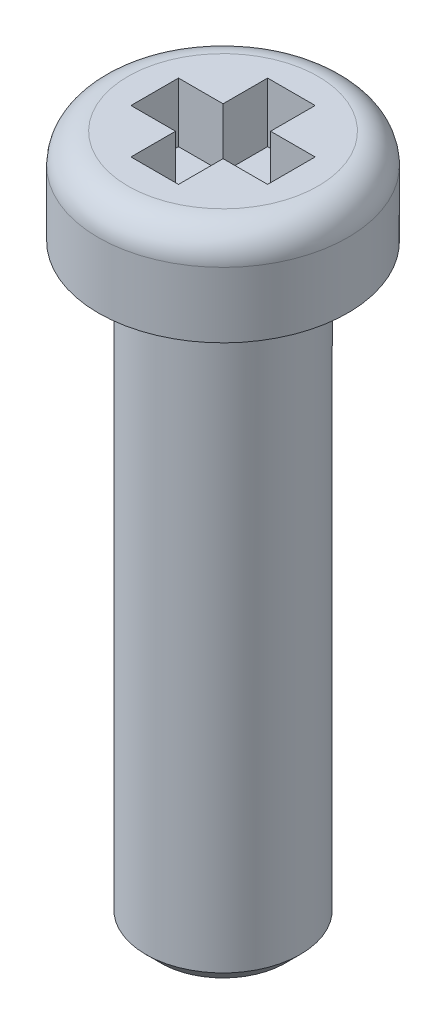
ISO-10303-21;
HEADER;
FILE_DESCRIPTION(('STEP AP214'),'2;1');
FILE_NAME('part.step','',(''),(''),'','','');
FILE_SCHEMA(('AUTOMOTIVE_DESIGN { 1 0 10303 214 1 1 1 1 }'));
ENDSEC;
DATA;
#1=APPLICATION_CONTEXT('core data for automotive mechanical design processes');
#2=APPLICATION_PROTOCOL_DEFINITION('international standard','automotive_design',2000,#1);
#3=PRODUCT_CONTEXT('',#1,'mechanical');
#4=PRODUCT('Part','Part','',(#3));
#5=PRODUCT_RELATED_PRODUCT_CATEGORY('part','',(#4));
#6=PRODUCT_DEFINITION_FORMATION('','',#4);
#7=PRODUCT_DEFINITION_CONTEXT('part definition',#1,'design');
#8=PRODUCT_DEFINITION('design','',#6,#7);
#9=PRODUCT_DEFINITION_SHAPE('','',#8);
#10=(LENGTH_UNIT() NAMED_UNIT(*) SI_UNIT(.MILLI.,.METRE.));
#11=(NAMED_UNIT(*) PLANE_ANGLE_UNIT() SI_UNIT($,.RADIAN.));
#12=(NAMED_UNIT(*) SI_UNIT($,.STERADIAN.) SOLID_ANGLE_UNIT());
#13=UNCERTAINTY_MEASURE_WITH_UNIT(LENGTH_MEASURE(1.E-05),#10,'distance_accuracy_value','');
#14=(GEOMETRIC_REPRESENTATION_CONTEXT(3) GLOBAL_UNCERTAINTY_ASSIGNED_CONTEXT((#13)) GLOBAL_UNIT_ASSIGNED_CONTEXT((#10,
#11,#12)) REPRESENTATION_CONTEXT('',''));
#15=CARTESIAN_POINT('',(0.,0.,0.));
#16=DIRECTION('',(0.,0.,1.));
#17=DIRECTION('',(1.,0.,0.));
#18=AXIS2_PLACEMENT_3D('',#15,#16,#17);
#19=CARTESIAN_POINT('',(2.1,0.,0.));
#20=DIRECTION('',(0.,1.,0.));
#21=DIRECTION('',(0.,0.,1.));
#22=AXIS2_PLACEMENT_3D('',#19,#20,#21);
#23=PLANE('',#22);
#24=CARTESIAN_POINT('',(0.,0.,0.));
#25=DIRECTION('',(0.,1.,0.));
#26=DIRECTION('',(0.,0.,1.));
#27=AXIS2_PLACEMENT_3D('',#24,#25,#26);
#28=CIRCLE('',#27,1.5);
#29=CARTESIAN_POINT('',(0.,0.,1.5));
#30=VERTEX_POINT('',#29);
#31=EDGE_CURVE('E209',#30,#30,#28,.T.);
#32=ORIENTED_EDGE('',*,*,#31,.T.);
#33=EDGE_LOOP('',(#32));
#34=FACE_BOUND('',#33,.T.);
#35=CARTESIAN_POINT('',(0.,0.,0.));
#36=DIRECTION('',(0.,1.,0.));
#37=DIRECTION('',(0.,0.,1.));
#38=AXIS2_PLACEMENT_3D('',#35,#36,#37);
#39=CIRCLE('',#38,2.1);
#40=CARTESIAN_POINT('',(0.,0.,2.1));
#41=VERTEX_POINT('',#40);
#42=EDGE_CURVE('E203',#41,#41,#39,.T.);
#43=ORIENTED_EDGE('',*,*,#42,.F.);
#44=EDGE_LOOP('',(#43));
#45=FACE_BOUND('',#44,.T.);
#46=ADVANCED_FACE('F31',(#34,#45),#23,.F.);
#47=CARTESIAN_POINT('',(0.4,0.6,1.15));
#48=DIRECTION('',(1.,0.,0.));
#49=DIRECTION('',(0.,0.,-1.));
#50=AXIS2_PLACEMENT_3D('',#47,#48,#49);
#51=PLANE('',#50);
#52=DIRECTION('',(0.,1.,0.));
#53=VECTOR('',#52,1.);
#54=CARTESIAN_POINT('',(0.4,0.6,0.399999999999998));
#55=LINE('',#54,#53);
#56=CARTESIAN_POINT('',(0.4,0.6,0.399999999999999));
#57=VERTEX_POINT('',#56);
#58=CARTESIAN_POINT('',(0.4,1.6,0.399999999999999));
#59=VERTEX_POINT('',#58);
#60=EDGE_CURVE('E153',#57,#59,#55,.T.);
#61=ORIENTED_EDGE('',*,*,#60,.F.);
#62=DIRECTION('',(0.,0.,-1.));
#63=VECTOR('',#62,1.);
#64=CARTESIAN_POINT('',(0.4,0.6,1.15));
#65=LINE('',#64,#63);
#66=CARTESIAN_POINT('',(0.4,0.6,1.15));
#67=VERTEX_POINT('',#66);
#68=EDGE_CURVE('E162',#67,#57,#65,.T.);
#69=ORIENTED_EDGE('',*,*,#68,.F.);
#70=DIRECTION('',(0.,1.,0.));
#71=VECTOR('',#70,1.);
#72=CARTESIAN_POINT('',(0.4,0.6,1.15));
#73=LINE('',#72,#71);
#74=CARTESIAN_POINT('',(0.4,1.6,1.15));
#75=VERTEX_POINT('',#74);
#76=EDGE_CURVE('E188',#67,#75,#73,.T.);
#77=ORIENTED_EDGE('',*,*,#76,.T.);
#78=DIRECTION('',(0.,0.,-1.));
#79=VECTOR('',#78,1.);
#80=CARTESIAN_POINT('',(0.4,1.6,1.15));
#81=LINE('',#80,#79);
#82=EDGE_CURVE('E175',#75,#59,#81,.T.);
#83=ORIENTED_EDGE('',*,*,#82,.T.);
#84=EDGE_LOOP('',(#61,#69,#77,#83));
#85=FACE_BOUND('',#84,.T.);
#86=ADVANCED_FACE('F225',(#85),#51,.F.);
#87=CARTESIAN_POINT('',(-0.4,0.6,1.15));
#88=DIRECTION('',(1.,0.,0.));
#89=DIRECTION('',(0.,0.,-1.));
#90=AXIS2_PLACEMENT_3D('',#87,#88,#89);
#91=PLANE('',#90);
#92=DIRECTION('',(0.,0.,-1.));
#93=VECTOR('',#92,1.);
#94=CARTESIAN_POINT('',(-0.4,0.6,1.15));
#95=LINE('',#94,#93);
#96=CARTESIAN_POINT('',(-0.4,0.6,1.15));
#97=VERTEX_POINT('',#96);
#98=CARTESIAN_POINT('',(-0.4,0.6,0.4));
#99=VERTEX_POINT('',#98);
#100=EDGE_CURVE('E169',#97,#99,#95,.T.);
#101=ORIENTED_EDGE('',*,*,#100,.T.);
#102=DIRECTION('',(0.,1.,0.));
#103=VECTOR('',#102,1.);
#104=CARTESIAN_POINT('',(-0.4,0.6,0.400000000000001));
#105=LINE('',#104,#103);
#106=CARTESIAN_POINT('',(-0.4,1.6,0.400000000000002));
#107=VERTEX_POINT('',#106);
#108=EDGE_CURVE('E150',#99,#107,#105,.T.);
#109=ORIENTED_EDGE('',*,*,#108,.T.);
#110=DIRECTION('',(0.,0.,-1.));
#111=VECTOR('',#110,1.);
#112=CARTESIAN_POINT('',(-0.4,1.6,1.15));
#113=LINE('',#112,#111);
#114=CARTESIAN_POINT('',(-0.4,1.6,1.15));
#115=VERTEX_POINT('',#114);
#116=EDGE_CURVE('E182',#115,#107,#113,.T.);
#117=ORIENTED_EDGE('',*,*,#116,.F.);
#118=DIRECTION('',(0.,1.,0.));
#119=VECTOR('',#118,1.);
#120=CARTESIAN_POINT('',(-0.4,0.6,1.15));
#121=LINE('',#120,#119);
#122=EDGE_CURVE('E191',#97,#115,#121,.T.);
#123=ORIENTED_EDGE('',*,*,#122,.F.);
#124=EDGE_LOOP('',(#101,#109,#117,#123));
#125=FACE_BOUND('',#124,.T.);
#126=ADVANCED_FACE('F231',(#125),#91,.T.);
#127=CARTESIAN_POINT('',(0.,11.592517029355,0.));
#128=DIRECTION('',(0.,1.,0.));
#129=DIRECTION('',(0.,0.,1.));
#130=AXIS2_PLACEMENT_3D('',#127,#128,#129);
#131=CYLINDRICAL_SURFACE('',#130,2.1);
#132=CARTESIAN_POINT('',(0.,1.1,0.));
#133=DIRECTION('',(0.,1.,0.));
#134=DIRECTION('',(0.,0.,1.));
#135=AXIS2_PLACEMENT_3D('',#132,#133,#134);
#136=CIRCLE('',#135,2.1);
#137=CARTESIAN_POINT('',(0.,1.1,2.1));
#138=VERTEX_POINT('',#137);
#139=EDGE_CURVE('E200',#138,#138,#136,.T.);
#140=ORIENTED_EDGE('',*,*,#139,.F.);
#141=EDGE_LOOP('',(#140));
#142=FACE_BOUND('',#141,.T.);
#143=ORIENTED_EDGE('',*,*,#42,.T.);
#144=EDGE_LOOP('',(#143));
#145=FACE_BOUND('',#144,.T.);
#146=ADVANCED_FACE('F237',(#142,#145),#131,.T.);
#147=CARTESIAN_POINT('',(0.,1.1,0.));
#148=DIRECTION('',(0.,1.,0.));
#149=DIRECTION('',(0.,0.,1.));
#150=AXIS2_PLACEMENT_3D('',#147,#148,#149);
#151=TOROIDAL_SURFACE('',#150,1.6,0.5);
#152=CARTESIAN_POINT('',(0.,1.6,0.));
#153=DIRECTION('',(0.,1.,0.));
#154=DIRECTION('',(0.,0.,1.));
#155=AXIS2_PLACEMENT_3D('',#152,#153,#154);
#156=CIRCLE('',#155,1.6);
#157=CARTESIAN_POINT('',(0.,1.6,1.6));
#158=VERTEX_POINT('',#157);
#159=EDGE_CURVE('E190',#158,#158,#156,.T.);
#160=ORIENTED_EDGE('',*,*,#159,.F.);
#161=EDGE_LOOP('',(#160));
#162=FACE_BOUND('',#161,.T.);
#163=ORIENTED_EDGE('',*,*,#139,.T.);
#164=EDGE_LOOP('',(#163));
#165=FACE_BOUND('',#164,.T.);
#166=ADVANCED_FACE('F240',(#162,#165),#151,.T.);
#167=CARTESIAN_POINT('',(0.,1.6,0.));
#168=DIRECTION('',(0.,-1.,0.));
#169=DIRECTION('',(0.,0.,-1.));
#170=AXIS2_PLACEMENT_3D('',#167,#168,#169);
#171=PLANE('',#170);
#172=CARTESIAN_POINT('',(0.4,1.6,-0.400000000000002));
#173=VERTEX_POINT('',#172);
#174=CARTESIAN_POINT('',(0.4,1.6,-1.15));
#175=VERTEX_POINT('',#174);
#176=EDGE_CURVE('E161',#173,#175,#81,.T.);
#177=ORIENTED_EDGE('',*,*,#176,.F.);
#178=DIRECTION('',(-1.,0.,0.));
#179=VECTOR('',#178,1.);
#180=CARTESIAN_POINT('',(1.15,1.6,-0.400000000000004));
#181=LINE('',#180,#179);
#182=CARTESIAN_POINT('',(1.15,1.6,-0.400000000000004));
#183=VERTEX_POINT('',#182);
#184=EDGE_CURVE('E438',#183,#173,#181,.T.);
#185=ORIENTED_EDGE('',*,*,#184,.F.);
#186=DIRECTION('',(0.,0.,1.));
#187=VECTOR('',#186,1.);
#188=CARTESIAN_POINT('',(1.15,1.6,-0.400000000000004));
#189=LINE('',#188,#187);
#190=CARTESIAN_POINT('',(1.15,1.6,0.399999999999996));
#191=VERTEX_POINT('',#190);
#192=EDGE_CURVE('E128',#183,#191,#189,.T.);
#193=ORIENTED_EDGE('',*,*,#192,.T.);
#194=DIRECTION('',(-1.,0.,0.));
#195=VECTOR('',#194,1.);
#196=CARTESIAN_POINT('',(1.15,1.6,0.399999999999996));
#197=LINE('',#196,#195);
#198=EDGE_CURVE('E423',#191,#59,#197,.T.);
#199=ORIENTED_EDGE('',*,*,#198,.T.);
#200=ORIENTED_EDGE('',*,*,#82,.F.);
#201=DIRECTION('',(-1.,0.,0.));
#202=VECTOR('',#201,1.);
#203=CARTESIAN_POINT('',(0.4,1.6,1.15));
#204=LINE('',#203,#202);
#205=EDGE_CURVE('E185',#75,#115,#204,.T.);
#206=ORIENTED_EDGE('',*,*,#205,.T.);
#207=ORIENTED_EDGE('',*,*,#116,.T.);
#208=CARTESIAN_POINT('',(-1.15,1.6,0.400000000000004));
#209=VERTEX_POINT('',#208);
#210=EDGE_CURVE('E429',#107,#209,#197,.T.);
#211=ORIENTED_EDGE('',*,*,#210,.T.);
#212=DIRECTION('',(0.,0.,-1.));
#213=VECTOR('',#212,1.);
#214=CARTESIAN_POINT('',(-1.15,1.6,0.400000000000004));
#215=LINE('',#214,#213);
#216=CARTESIAN_POINT('',(-1.15,1.6,-0.399999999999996));
#217=VERTEX_POINT('',#216);
#218=EDGE_CURVE('E433',#209,#217,#215,.T.);
#219=ORIENTED_EDGE('',*,*,#218,.T.);
#220=CARTESIAN_POINT('',(-0.4,1.6,-0.399999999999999));
#221=VERTEX_POINT('',#220);
#222=EDGE_CURVE('E141',#221,#217,#181,.T.);
#223=ORIENTED_EDGE('',*,*,#222,.F.);
#224=CARTESIAN_POINT('',(-0.4,1.6,-1.15));
#225=VERTEX_POINT('',#224);
#226=EDGE_CURVE('E181',#221,#225,#113,.T.);
#227=ORIENTED_EDGE('',*,*,#226,.T.);
#228=DIRECTION('',(1.,0.,0.));
#229=VECTOR('',#228,1.);
#230=CARTESIAN_POINT('',(-0.4,1.6,-1.15));
#231=LINE('',#230,#229);
#232=EDGE_CURVE('E178',#225,#175,#231,.T.);
#233=ORIENTED_EDGE('',*,*,#232,.T.);
#234=EDGE_LOOP('',(#177,#185,#193,#199,#200,#206,#207,#211,#219,#223,#227,#233));
#235=FACE_BOUND('',#234,.T.);
#236=ORIENTED_EDGE('',*,*,#159,.T.);
#237=EDGE_LOOP('',(#236));
#238=FACE_BOUND('',#237,.T.);
#239=ADVANCED_FACE('F244',(#235,#238),#171,.F.);
#240=CARTESIAN_POINT('',(0.4,0.6,-0.4));
#241=VERTEX_POINT('',#240);
#242=CARTESIAN_POINT('',(0.4,0.6,-1.15));
#243=VERTEX_POINT('',#242);
#244=EDGE_CURVE('E166',#241,#243,#65,.T.);
#245=ORIENTED_EDGE('',*,*,#244,.F.);
#246=DIRECTION('',(0.,1.,0.));
#247=VECTOR('',#246,1.);
#248=CARTESIAN_POINT('',(0.4,0.6,-0.400000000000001));
#249=LINE('',#248,#247);
#250=EDGE_CURVE('E158',#241,#173,#249,.T.);
#251=ORIENTED_EDGE('',*,*,#250,.T.);
#252=ORIENTED_EDGE('',*,*,#176,.T.);
#253=DIRECTION('',(0.,1.,0.));
#254=VECTOR('',#253,1.);
#255=CARTESIAN_POINT('',(0.4,0.6,-1.15));
#256=LINE('',#255,#254);
#257=EDGE_CURVE('E174',#243,#175,#256,.T.);
#258=ORIENTED_EDGE('',*,*,#257,.F.);
#259=EDGE_LOOP('',(#245,#251,#252,#258));
#260=FACE_BOUND('',#259,.T.);
#261=ADVANCED_FACE('F234',(#260),#51,.F.);
#262=CARTESIAN_POINT('',(0.4,0.6,1.15));
#263=DIRECTION('',(0.,0.,-1.));
#264=DIRECTION('',(-1.,0.,0.));
#265=AXIS2_PLACEMENT_3D('',#262,#263,#264);
#266=PLANE('',#265);
#267=ORIENTED_EDGE('',*,*,#205,.F.);
#268=ORIENTED_EDGE('',*,*,#76,.F.);
#269=DIRECTION('',(-1.,0.,0.));
#270=VECTOR('',#269,1.);
#271=CARTESIAN_POINT('',(0.4,0.6,1.15));
#272=LINE('',#271,#270);
#273=EDGE_CURVE('E172',#67,#97,#272,.T.);
#274=ORIENTED_EDGE('',*,*,#273,.T.);
#275=ORIENTED_EDGE('',*,*,#122,.T.);
#276=EDGE_LOOP('',(#267,#268,#274,#275));
#277=FACE_BOUND('',#276,.T.);
#278=ADVANCED_FACE('F250',(#277),#266,.T.);
#279=DIRECTION('',(0.,1.,0.));
#280=VECTOR('',#279,1.);
#281=CARTESIAN_POINT('',(-0.4,0.6,-0.399999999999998));
#282=LINE('',#281,#280);
#283=CARTESIAN_POINT('',(-0.4,0.6,-0.399999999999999));
#284=VERTEX_POINT('',#283);
#285=EDGE_CURVE('E156',#284,#221,#282,.T.);
#286=ORIENTED_EDGE('',*,*,#285,.F.);
#287=CARTESIAN_POINT('',(-0.4,0.6,-1.15));
#288=VERTEX_POINT('',#287);
#289=EDGE_CURVE('E124',#284,#288,#95,.T.);
#290=ORIENTED_EDGE('',*,*,#289,.T.);
#291=DIRECTION('',(0.,1.,0.));
#292=VECTOR('',#291,1.);
#293=CARTESIAN_POINT('',(-0.4,0.6,-1.15));
#294=LINE('',#293,#292);
#295=EDGE_CURVE('E193',#288,#225,#294,.T.);
#296=ORIENTED_EDGE('',*,*,#295,.T.);
#297=ORIENTED_EDGE('',*,*,#226,.F.);
#298=EDGE_LOOP('',(#286,#290,#296,#297));
#299=FACE_BOUND('',#298,.T.);
#300=ADVANCED_FACE('F255',(#299),#91,.T.);
#301=CARTESIAN_POINT('',(-0.4,0.6,-1.15));
#302=DIRECTION('',(0.,0.,1.));
#303=DIRECTION('',(1.,0.,0.));
#304=AXIS2_PLACEMENT_3D('',#301,#302,#303);
#305=PLANE('',#304);
#306=ORIENTED_EDGE('',*,*,#232,.F.);
#307=ORIENTED_EDGE('',*,*,#295,.F.);
#308=DIRECTION('',(1.,0.,0.));
#309=VECTOR('',#308,1.);
#310=CARTESIAN_POINT('',(-0.4,0.6,-1.15));
#311=LINE('',#310,#309);
#312=EDGE_CURVE('E165',#288,#243,#311,.T.);
#313=ORIENTED_EDGE('',*,*,#312,.T.);
#314=ORIENTED_EDGE('',*,*,#257,.T.);
#315=EDGE_LOOP('',(#306,#307,#313,#314));
#316=FACE_BOUND('',#315,.T.);
#317=ADVANCED_FACE('F252',(#316),#305,.T.);
#318=CARTESIAN_POINT('',(0.4,0.6,-1.15));
#319=DIRECTION('',(0.,-1.,0.));
#320=DIRECTION('',(0.,0.,-1.));
#321=AXIS2_PLACEMENT_3D('',#318,#319,#320);
#322=PLANE('',#321);
#323=ORIENTED_EDGE('',*,*,#289,.F.);
#324=DIRECTION('',(-1.,0.,0.));
#325=VECTOR('',#324,1.);
#326=CARTESIAN_POINT('',(1.15,0.6,-0.400000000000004));
#327=LINE('',#326,#325);
#328=CARTESIAN_POINT('',(-1.15,0.6,-0.399999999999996));
#329=VERTEX_POINT('',#328);
#330=EDGE_CURVE('E119',#284,#329,#327,.T.);
#331=ORIENTED_EDGE('',*,*,#330,.T.);
#332=DIRECTION('',(0.,0.,-1.));
#333=VECTOR('',#332,1.);
#334=CARTESIAN_POINT('',(-1.15,0.6,0.400000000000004));
#335=LINE('',#334,#333);
#336=CARTESIAN_POINT('',(-1.15,0.6,0.400000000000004));
#337=VERTEX_POINT('',#336);
#338=EDGE_CURVE('E122',#337,#329,#335,.T.);
#339=ORIENTED_EDGE('',*,*,#338,.F.);
#340=DIRECTION('',(-1.,0.,0.));
#341=VECTOR('',#340,1.);
#342=CARTESIAN_POINT('',(1.15,0.6,0.399999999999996));
#343=LINE('',#342,#341);
#344=EDGE_CURVE('E46',#99,#337,#343,.T.);
#345=ORIENTED_EDGE('',*,*,#344,.F.);
#346=ORIENTED_EDGE('',*,*,#100,.F.);
#347=ORIENTED_EDGE('',*,*,#273,.F.);
#348=ORIENTED_EDGE('',*,*,#68,.T.);
#349=CARTESIAN_POINT('',(1.15,0.6,0.399999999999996));
#350=VERTEX_POINT('',#349);
#351=EDGE_CURVE('E146',#350,#57,#343,.T.);
#352=ORIENTED_EDGE('',*,*,#351,.F.);
#353=DIRECTION('',(0.,0.,1.));
#354=VECTOR('',#353,1.);
#355=CARTESIAN_POINT('',(1.15,0.6,-0.400000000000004));
#356=LINE('',#355,#354);
#357=CARTESIAN_POINT('',(1.15,0.6,-0.400000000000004));
#358=VERTEX_POINT('',#357);
#359=EDGE_CURVE('E142',#358,#350,#356,.T.);
#360=ORIENTED_EDGE('',*,*,#359,.F.);
#361=EDGE_CURVE('E53',#358,#241,#327,.T.);
#362=ORIENTED_EDGE('',*,*,#361,.T.);
#363=ORIENTED_EDGE('',*,*,#244,.T.);
#364=ORIENTED_EDGE('',*,*,#312,.F.);
#365=EDGE_LOOP('',(#323,#331,#339,#345,#346,#347,#348,#352,#360,#362,#363,#364));
#366=FACE_BOUND('',#365,.T.);
#367=ADVANCED_FACE('F121',(#366),#322,.F.);
#368=CARTESIAN_POINT('',(1.15,0.6,0.399999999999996));
#369=DIRECTION('',(0.,0.,-1.));
#370=DIRECTION('',(-1.,0.,0.));
#371=AXIS2_PLACEMENT_3D('',#368,#369,#370);
#372=PLANE('',#371);
#373=ORIENTED_EDGE('',*,*,#344,.T.);
#374=DIRECTION('',(0.,1.,0.));
#375=VECTOR('',#374,1.);
#376=CARTESIAN_POINT('',(-1.15,0.6,0.400000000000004));
#377=LINE('',#376,#375);
#378=EDGE_CURVE('E137',#337,#209,#377,.T.);
#379=ORIENTED_EDGE('',*,*,#378,.T.);
#380=ORIENTED_EDGE('',*,*,#210,.F.);
#381=ORIENTED_EDGE('',*,*,#108,.F.);
#382=EDGE_LOOP('',(#373,#379,#380,#381));
#383=FACE_BOUND('',#382,.T.);
#384=ADVANCED_FACE('F265',(#383),#372,.T.);
#385=CARTESIAN_POINT('',(1.15,0.6,-0.400000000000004));
#386=DIRECTION('',(0.,0.,-1.));
#387=DIRECTION('',(-1.,0.,0.));
#388=AXIS2_PLACEMENT_3D('',#385,#386,#387);
#389=PLANE('',#388);
#390=ORIENTED_EDGE('',*,*,#285,.T.);
#391=ORIENTED_EDGE('',*,*,#222,.T.);
#392=DIRECTION('',(0.,1.,0.));
#393=VECTOR('',#392,1.);
#394=CARTESIAN_POINT('',(-1.15,0.6,-0.399999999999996));
#395=LINE('',#394,#393);
#396=EDGE_CURVE('E135',#329,#217,#395,.T.);
#397=ORIENTED_EDGE('',*,*,#396,.F.);
#398=ORIENTED_EDGE('',*,*,#330,.F.);
#399=EDGE_LOOP('',(#390,#391,#397,#398));
#400=FACE_BOUND('',#399,.T.);
#401=ADVANCED_FACE('F139',(#400),#389,.F.);
#402=CARTESIAN_POINT('',(-1.15,0.6,0.400000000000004));
#403=DIRECTION('',(1.,0.,0.));
#404=DIRECTION('',(0.,0.,-1.));
#405=AXIS2_PLACEMENT_3D('',#402,#403,#404);
#406=PLANE('',#405);
#407=ORIENTED_EDGE('',*,*,#218,.F.);
#408=ORIENTED_EDGE('',*,*,#378,.F.);
#409=ORIENTED_EDGE('',*,*,#338,.T.);
#410=ORIENTED_EDGE('',*,*,#396,.T.);
#411=EDGE_LOOP('',(#407,#408,#409,#410));
#412=FACE_BOUND('',#411,.T.);
#413=ADVANCED_FACE('F134',(#412),#406,.T.);
#414=ORIENTED_EDGE('',*,*,#361,.F.);
#415=DIRECTION('',(0.,1.,0.));
#416=VECTOR('',#415,1.);
#417=CARTESIAN_POINT('',(1.15,0.6,-0.400000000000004));
#418=LINE('',#417,#416);
#419=EDGE_CURVE('E154',#358,#183,#418,.T.);
#420=ORIENTED_EDGE('',*,*,#419,.T.);
#421=ORIENTED_EDGE('',*,*,#184,.T.);
#422=ORIENTED_EDGE('',*,*,#250,.F.);
#423=EDGE_LOOP('',(#414,#420,#421,#422));
#424=FACE_BOUND('',#423,.T.);
#425=ADVANCED_FACE('F268',(#424),#389,.F.);
#426=ORIENTED_EDGE('',*,*,#60,.T.);
#427=ORIENTED_EDGE('',*,*,#198,.F.);
#428=DIRECTION('',(0.,1.,0.));
#429=VECTOR('',#428,1.);
#430=CARTESIAN_POINT('',(1.15,0.6,0.399999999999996));
#431=LINE('',#430,#429);
#432=EDGE_CURVE('E144',#350,#191,#431,.T.);
#433=ORIENTED_EDGE('',*,*,#432,.F.);
#434=ORIENTED_EDGE('',*,*,#351,.T.);
#435=EDGE_LOOP('',(#426,#427,#433,#434));
#436=FACE_BOUND('',#435,.T.);
#437=ADVANCED_FACE('F274',(#436),#372,.T.);
#438=CARTESIAN_POINT('',(1.15,0.6,-0.400000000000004));
#439=DIRECTION('',(-1.,0.,0.));
#440=DIRECTION('',(0.,0.,1.));
#441=AXIS2_PLACEMENT_3D('',#438,#439,#440);
#442=PLANE('',#441);
#443=ORIENTED_EDGE('',*,*,#192,.F.);
#444=ORIENTED_EDGE('',*,*,#419,.F.);
#445=ORIENTED_EDGE('',*,*,#359,.T.);
#446=ORIENTED_EDGE('',*,*,#432,.T.);
#447=EDGE_LOOP('',(#443,#444,#445,#446));
#448=FACE_BOUND('',#447,.T.);
#449=ADVANCED_FACE('F275',(#448),#442,.T.);
#450=CARTESIAN_POINT('',(0.,-10.,0.));
#451=DIRECTION('',(0.,1.,0.));
#452=DIRECTION('',(0.,0.,1.));
#453=AXIS2_PLACEMENT_3D('',#450,#451,#452);
#454=CYLINDRICAL_SURFACE('',#453,1.3);
#455=CARTESIAN_POINT('',(0.,-9.75,0.));
#456=DIRECTION('',(0.,-1.,0.));
#457=DIRECTION('',(0.,0.,-1.));
#458=AXIS2_PLACEMENT_3D('',#455,#456,#457);
#459=CIRCLE('',#458,1.3);
#460=CARTESIAN_POINT('',(0.,-9.75,-1.3));
#461=VERTEX_POINT('',#460);
#462=EDGE_CURVE('E11',#461,#461,#459,.F.);
#463=ORIENTED_EDGE('',*,*,#462,.T.);
#464=EDGE_LOOP('',(#463));
#465=FACE_BOUND('',#464,.T.);
#466=CARTESIAN_POINT('',(0.,-0.200000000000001,0.));
#467=DIRECTION('',(0.,1.,0.));
#468=DIRECTION('',(0.,0.,1.));
#469=AXIS2_PLACEMENT_3D('',#466,#467,#468);
#470=CIRCLE('',#469,1.3);
#471=CARTESIAN_POINT('',(0.,-0.200000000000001,1.3));
#472=VERTEX_POINT('',#471);
#473=EDGE_CURVE('E206',#472,#472,#470,.F.);
#474=ORIENTED_EDGE('',*,*,#473,.T.);
#475=EDGE_LOOP('',(#474));
#476=FACE_BOUND('',#475,.T.);
#477=ADVANCED_FACE('F278',(#465,#476),#454,.T.);
#478=CARTESIAN_POINT('',(0.,-10.,0.));
#479=DIRECTION('',(0.,-1.,0.));
#480=DIRECTION('',(0.,0.,-1.));
#481=AXIS2_PLACEMENT_3D('',#478,#479,#480);
#482=PLANE('',#481);
#483=CARTESIAN_POINT('',(0.,-10.,0.));
#484=DIRECTION('',(0.,-1.,0.));
#485=DIRECTION('',(0.,0.,-1.));
#486=AXIS2_PLACEMENT_3D('',#483,#484,#485);
#487=CIRCLE('',#486,1.05);
#488=CARTESIAN_POINT('',(0.,-10.,-1.05));
#489=VERTEX_POINT('',#488);
#490=EDGE_CURVE('E39',#489,#489,#487,.T.);
#491=ORIENTED_EDGE('',*,*,#490,.T.);
#492=EDGE_LOOP('',(#491));
#493=FACE_BOUND('',#492,.T.);
#494=ADVANCED_FACE('F214',(#493),#482,.T.);
#495=CARTESIAN_POINT('',(0.,-0.200000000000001,0.));
#496=DIRECTION('',(0.,1.,0.));
#497=DIRECTION('',(0.,0.,1.));
#498=AXIS2_PLACEMENT_3D('',#495,#496,#497);
#499=TOROIDAL_SURFACE('',#498,1.5,0.2);
#500=ORIENTED_EDGE('',*,*,#31,.F.);
#501=EDGE_LOOP('',(#500));
#502=FACE_BOUND('',#501,.T.);
#503=ORIENTED_EDGE('',*,*,#473,.F.);
#504=EDGE_LOOP('',(#503));
#505=FACE_BOUND('',#504,.T.);
#506=ADVANCED_FACE('F217',(#502,#505),#499,.F.);
#507=CARTESIAN_POINT('',(0.,-10.,0.));
#508=DIRECTION('',(0.,1.,0.));
#509=DIRECTION('',(0.,0.,1.));
#510=AXIS2_PLACEMENT_3D('',#507,#508,#509);
#511=CONICAL_SURFACE('',#510,1.05,0.785398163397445);
#512=ORIENTED_EDGE('',*,*,#462,.F.);
#513=EDGE_LOOP('',(#512));
#514=FACE_BOUND('',#513,.T.);
#515=ORIENTED_EDGE('',*,*,#490,.F.);
#516=EDGE_LOOP('',(#515));
#517=FACE_BOUND('',#516,.T.);
#518=ADVANCED_FACE('F33',(#514,#517),#511,.T.);
#519=CLOSED_SHELL('',(#46,#86,#126,#146,#166,#239,#261,#278,#300,#317,#367,#384,#401,#413,#425,
#437,#449,#477,#494,#506,#518));
#520=MANIFOLD_SOLID_BREP('B2',#519);
#521=ADVANCED_BREP_SHAPE_REPRESENTATION('',(#18,#520),#14);
#522=SHAPE_DEFINITION_REPRESENTATION(#9,#521);
ENDSEC;
END-ISO-10303-21;
